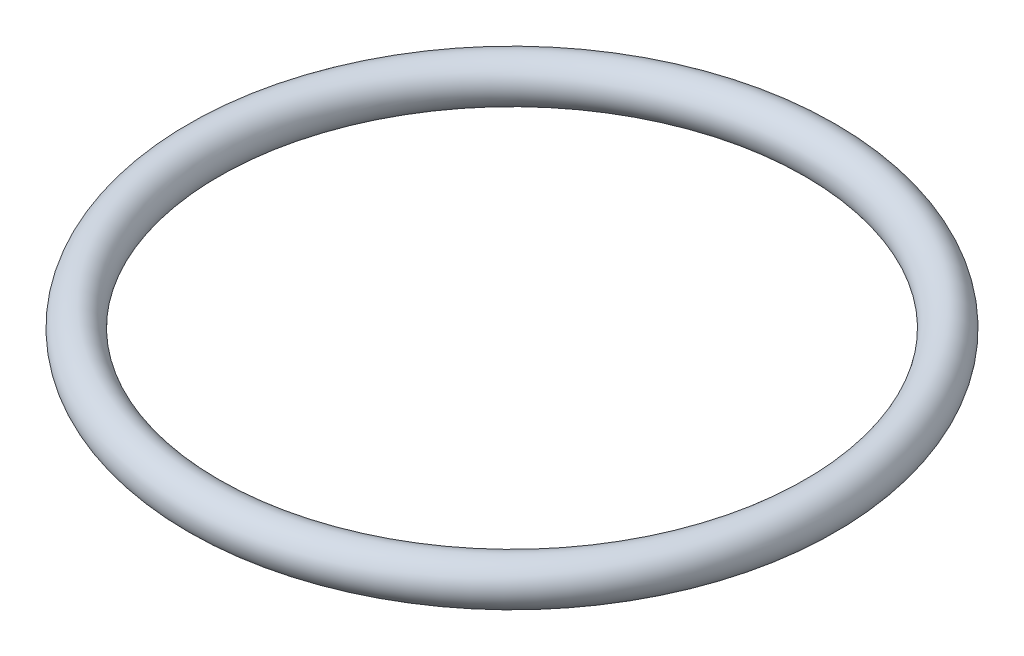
ISO-10303-21;
HEADER;
FILE_DESCRIPTION(('STEP AP214'),'2;1');
FILE_NAME('part.step','',(''),(''),'','','');
FILE_SCHEMA(('AUTOMOTIVE_DESIGN { 1 0 10303 214 1 1 1 1 }'));
ENDSEC;
DATA;
#1=APPLICATION_CONTEXT('core data for automotive mechanical design processes');
#2=APPLICATION_PROTOCOL_DEFINITION('international standard','automotive_design',2000,#1);
#3=PRODUCT_CONTEXT('',#1,'mechanical');
#4=PRODUCT('Part','Part','',(#3));
#5=PRODUCT_RELATED_PRODUCT_CATEGORY('part','',(#4));
#6=PRODUCT_DEFINITION_FORMATION('','',#4);
#7=PRODUCT_DEFINITION_CONTEXT('part definition',#1,'design');
#8=PRODUCT_DEFINITION('design','',#6,#7);
#9=PRODUCT_DEFINITION_SHAPE('','',#8);
#10=(LENGTH_UNIT() NAMED_UNIT(*) SI_UNIT(.MILLI.,.METRE.));
#11=(NAMED_UNIT(*) PLANE_ANGLE_UNIT() SI_UNIT($,.RADIAN.));
#12=(NAMED_UNIT(*) SI_UNIT($,.STERADIAN.) SOLID_ANGLE_UNIT());
#13=UNCERTAINTY_MEASURE_WITH_UNIT(LENGTH_MEASURE(1.E-05),#10,'distance_accuracy_value','');
#14=(GEOMETRIC_REPRESENTATION_CONTEXT(3) GLOBAL_UNCERTAINTY_ASSIGNED_CONTEXT((#13)) GLOBAL_UNIT_ASSIGNED_CONTEXT((#10,
#11,#12)) REPRESENTATION_CONTEXT('',''));
#15=CARTESIAN_POINT('',(0.,0.,0.));
#16=DIRECTION('',(0.,0.,1.));
#17=DIRECTION('',(1.,0.,0.));
#18=AXIS2_PLACEMENT_3D('',#15,#16,#17);
#19=CARTESIAN_POINT('',(0.,0.8382,0.));
#20=DIRECTION('',(0.,-1.,0.));
#21=DIRECTION('',(0.,0.,-1.));
#22=AXIS2_PLACEMENT_3D('',#19,#20,#21);
#23=TOROIDAL_SURFACE('',#22,12.79525,0.889);
#24=CARTESIAN_POINT('',(0.,0.8382,-13.68425));
#25=VERTEX_POINT('',#24);
#26=VERTEX_LOOP('',#25);
#27=FACE_BOUND('',#26,.T.);
#28=ADVANCED_FACE('F32',(#27),#23,.T.);
#29=CLOSED_SHELL('',(#28));
#30=MANIFOLD_SOLID_BREP('B2',#29);
#31=ADVANCED_BREP_SHAPE_REPRESENTATION('',(#18,#30),#14);
#32=SHAPE_DEFINITION_REPRESENTATION(#9,#31);
ENDSEC;
END-ISO-10303-21;
